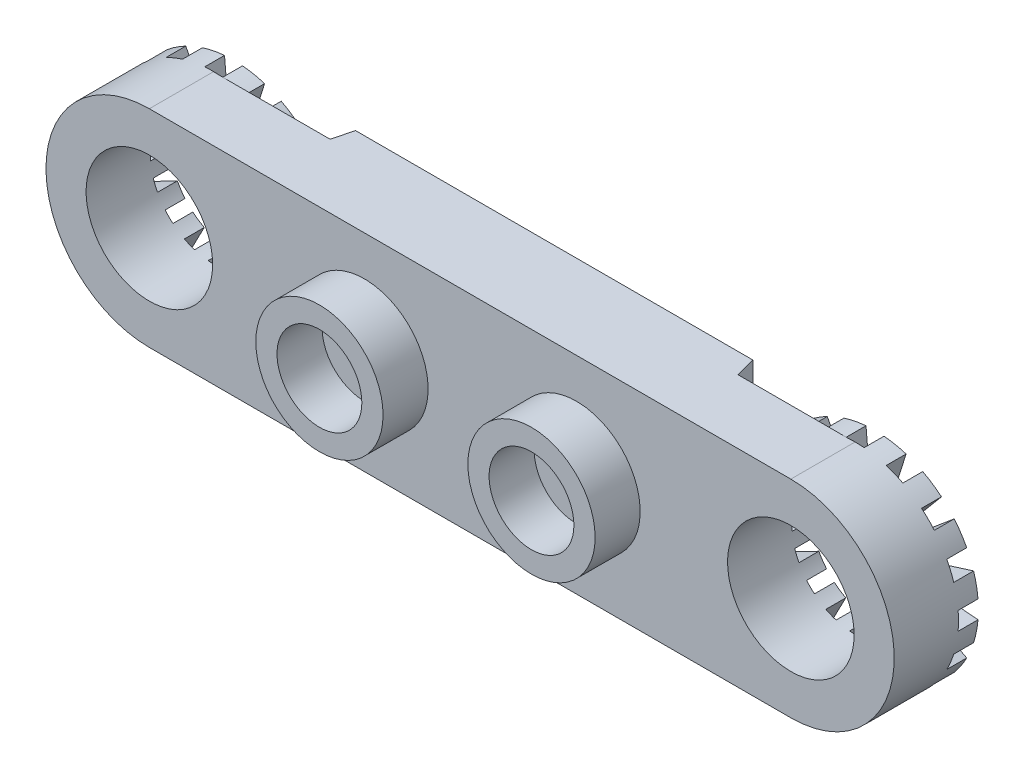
from build123d import *
from OCP.BRepFilletAPI import BRepFilletAPI_MakeChamfer

# Parameters (mm, degrees)
SKETCH1_R             = 2.3876
EXTRUDE1_DEPTH        = 1.2065
SKETCH3_W             = 14.9924
SKETCH3_H             = 7.8
EXTRUDE2_DEPTH        = 0.762
CHAMFER1_SIZE         = 0.2
CHAMFER1_SIZE2        = 0.76
SKETCH7_R             = 3.9
SKETCH7_R_2           = 2.3876
EXTRUDE4_DEPTH        = 0.762
CUT_EXTRUDE3_START    = -0.75
CUT_EXTRUDE3_DEPTH    = 0.75
CIRPATTERN1_COUNT     = 16
MIRROR2_START         = -0.75
MIRROR2_COPY_1_DEPTH  = 0.75
MIRROR2_COPY_2_DEPTH  = 0.75
MIRROR2_COPY_3_DEPTH  = 0.75
MIRROR2_COPY_4_DEPTH  = 0.75
MIRROR2_COPY_5_DEPTH  = 0.75
MIRROR2_COPY_6_DEPTH  = 0.75
MIRROR2_COPY_7_DEPTH  = 0.75
MIRROR2_COPY_8_DEPTH  = 0.75
MIRROR2_COPY_9_DEPTH  = 0.75
MIRROR2_COPY_10_DEPTH = 0.75
MIRROR2_COPY_11_DEPTH = 0.75
MIRROR2_COPY_12_DEPTH = 0.75
MIRROR2_COPY_13_DEPTH = 0.75
MIRROR2_COPY_14_DEPTH = 0.75
MIRROR2_COPY_15_DEPTH = 0.75
SKETCH10_W            = 12.8
SKETCH10_H            = 4.7
CUT_EXTRUDE4_DEPTH    = 1.7
SKETCH11_R            = 1.5
BOSS_EXTRUDE1_DEPTH   = 1.7
SKETCH12_R            = 2.4
BOSS_EXTRUDE2_DEPTH   = 1.7
SKETCH13_R            = 1.6
CUT_EXTRUDE5_DEPTH    = 1.7


with BuildPart() as part:
    # Sketch1 → Extrude1 (new, symmetric)
    with BuildSketch(Plane.XY):
        with BuildLine():
            Line((12.1, 3.9), (-12.1, 3.9))
            ThreePointArc((-12.1, 3.9), (-16, 0), (-12.1, -3.9))
            Line((-12.1, -3.9), (12.1, -3.9))
            ThreePointArc((12.1, -3.9), (16, 0), (12.1, 3.9))
        make_face()
        with Locations((-12.1, 0)):
            Circle(SKETCH1_R, mode=Mode.SUBTRACT)
        with Locations((12.1, 0)):
            Circle(SKETCH1_R, mode=Mode.SUBTRACT)
    extrude(amount=EXTRUDE1_DEPTH, both=True)

    # Sketch3 → Extrude2 (add)
    with BuildSketch(Plane(origin=(0, 0, -1.2065), x_dir=(-1, 0, 0), z_dir=(0, 0, -1))):
        Rectangle(SKETCH3_W, SKETCH3_H)
    extrude(amount=EXTRUDE2_DEPTH)

    # Chamfer1: one chamfer whose edges measure the first distance from different faces: ONE call of the kernel's chamfer builder (chamfer() names one face for all edges)
    chamfer1_edges_1 = [part.edges().sort_by_distance(p)[0] for p in [
        (7.4962, 0, -1.2065),
    ]]
    chamfer1_side_1 = [part.faces().sort_by_distance(p)[0] for p in [
        (7.61159264, 0, -1.2065),
    ]]
    chamfer1_edges_2 = [part.edges().sort_by_distance(p)[0] for p in [
        (-7.4962, 0, -1.2065),
    ]]
    chamfer1_side_2 = [part.faces().sort_by_distance(p)[0] for p in [
        (-15.88460736, 0, -1.2065),
    ]]
    chamfer1 = BRepFilletAPI_MakeChamfer(part.part.solid().wrapped)
    for e in chamfer1_edges_1:
        chamfer1.Add(CHAMFER1_SIZE, CHAMFER1_SIZE2, e.wrapped, chamfer1_side_1[0].wrapped)  # the first distance lies on this face
    for e in chamfer1_edges_2:
        chamfer1.Add(CHAMFER1_SIZE, CHAMFER1_SIZE2, e.wrapped, chamfer1_side_2[0].wrapped)  # the first distance lies on this face
    add(Compound.cast(chamfer1.Shape()), mode=Mode.REPLACE)

    # Sketch7 → Extrude4 (add)
    with BuildSketch(Plane(origin=(0, 0, -1.2065), x_dir=(-1, 0, 0), z_dir=(0, 0, -1))):
        with Locations((-12.1, 0)):
            Circle(SKETCH7_R)
        with Locations((-12.1, 0)):
            Circle(SKETCH7_R_2, mode=Mode.SUBTRACT)
    extrude4 = extrude(amount=EXTRUDE4_DEPTH)

    # Sketch8 → Cut-Extrude3 (cut)
    with BuildSketch(Plane(origin=(0, 0, -1.9685), x_dir=(-1, 0, 0), z_dir=(0, 0, -1)).offset(CUT_EXTRUDE3_START)):
        with BuildLine():
            Line((-12.308093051, 2.378514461), (-12.439907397, 3.885159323))
            ThreePointArc((-12.439907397, 3.885159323), (-12.1, 3.9), (-11.760092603, 3.885159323))
            Line((-11.760092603, 3.885159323), (-11.891906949, 2.378514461))
            ThreePointArc((-11.891906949, 2.378514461), (-12.1, 2.3876), (-12.308093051, 2.378514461))
        make_face()
    cut_extrude3 = extrude(amount=CUT_EXTRUDE3_DEPTH, mode=Mode.SUBTRACT)

    # CirPattern1: Cut-Extrude3 ×16 about axis
    cirpattern1_axis = Axis((12.1, 0, 0), (0, 0, 1))
    for i in range(1, CIRPATTERN1_COUNT):
        add(cut_extrude3.rotate(cirpattern1_axis, i * 360 / CIRPATTERN1_COUNT), mode=Mode.SUBTRACT)

    # Mirror2: Extrude4, Cut-Extrude3 across plane
    add(extrude4.mirror(Plane(origin=(0, 0, 0), x_dir=(0, 0, 1), z_dir=(1, 0, 0))))
    add(cut_extrude3.mirror(Plane(origin=(0, 0, 0), x_dir=(0, 0, 1), z_dir=(1, 0, 0))), mode=Mode.SUBTRACT)

    # Mirror2 copy 1 sketch → Mirror2 copy 1 (cut)
    with BuildSketch(Plane(origin=(-0.921057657, -4.630469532, -1.9685), x_dir=(0.9238795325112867, -0.3826834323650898, 0), z_dir=(0, 0, -1)).offset(MIRROR2_START)):
        with BuildLine():
            Line((-12.308093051, -2.378514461), (-12.439907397, -3.885159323))
            ThreePointArc((-12.439907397, -3.885159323), (-12.1, -3.9), (-11.760092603, -3.885159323))
            Line((-11.760092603, -3.885159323), (-11.891906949, -2.378514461))
            ThreePointArc((-11.891906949, -2.378514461), (-12.1, -2.3876), (-12.308093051, -2.378514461))
        make_face()
    extrude(amount=MIRROR2_COPY_1_DEPTH, mode=Mode.SUBTRACT)

    # Mirror2 copy 2 sketch → Mirror2 copy 2 (cut)
    with BuildSketch(Plane(origin=(-3.544007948, -8.555992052, -1.9685), x_dir=(0.7071067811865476, -0.7071067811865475, 0), z_dir=(0, 0, -1)).offset(MIRROR2_START)):
        with BuildLine():
            Line((-12.308093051, -2.378514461), (-12.439907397, -3.885159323))
            ThreePointArc((-12.439907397, -3.885159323), (-12.1, -3.9), (-11.760092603, -3.885159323))
            Line((-11.760092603, -3.885159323), (-11.891906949, -2.378514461))
            ThreePointArc((-11.891906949, -2.378514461), (-12.1, -2.3876), (-12.308093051, -2.378514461))
        make_face()
    extrude(amount=MIRROR2_COPY_2_DEPTH, mode=Mode.SUBTRACT)

    # Mirror2 copy 3 sketch → Mirror2 copy 3 (cut)
    with BuildSketch(Plane(origin=(-7.469530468, -11.178942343, -1.9685), x_dir=(0.38268343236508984, -0.9238795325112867, 0), z_dir=(0, 0, -1)).offset(MIRROR2_START)):
        with BuildLine():
            Line((-12.308093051, -2.378514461), (-12.439907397, -3.885159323))
            ThreePointArc((-12.439907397, -3.885159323), (-12.1, -3.9), (-11.760092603, -3.885159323))
            Line((-11.760092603, -3.885159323), (-11.891906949, -2.378514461))
            ThreePointArc((-11.891906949, -2.378514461), (-12.1, -2.3876), (-12.308093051, -2.378514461))
        make_face()
    extrude(amount=MIRROR2_COPY_3_DEPTH, mode=Mode.SUBTRACT)

    # Mirror2 copy 4 sketch → Mirror2 copy 4 (cut)
    with BuildSketch(Plane(origin=(-12.1, -12.1, -1.9685), x_dir=(0, -1, 0), z_dir=(0, 0, -1)).offset(MIRROR2_START)):
        with BuildLine():
            Line((-12.308093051, -2.378514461), (-12.439907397, -3.885159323))
            ThreePointArc((-12.439907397, -3.885159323), (-12.1, -3.9), (-11.760092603, -3.885159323))
            Line((-11.760092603, -3.885159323), (-11.891906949, -2.378514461))
            ThreePointArc((-11.891906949, -2.378514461), (-12.1, -2.3876), (-12.308093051, -2.378514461))
        make_face()
    extrude(amount=MIRROR2_COPY_4_DEPTH, mode=Mode.SUBTRACT)

    # Mirror2 copy 5 sketch → Mirror2 copy 5 (cut)
    with BuildSketch(Plane(origin=(-16.730469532, -11.178942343, -1.9685), x_dir=(-0.3826834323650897, -0.9238795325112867, 0), z_dir=(0, 0, -1)).offset(MIRROR2_START)):
        with BuildLine():
            Line((-12.308093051, -2.378514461), (-12.439907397, -3.885159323))
            ThreePointArc((-12.439907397, -3.885159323), (-12.1, -3.9), (-11.760092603, -3.885159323))
            Line((-11.760092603, -3.885159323), (-11.891906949, -2.378514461))
            ThreePointArc((-11.891906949, -2.378514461), (-12.1, -2.3876), (-12.308093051, -2.378514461))
        make_face()
    extrude(amount=MIRROR2_COPY_5_DEPTH, mode=Mode.SUBTRACT)

    # Mirror2 copy 6 sketch → Mirror2 copy 6 (cut)
    with BuildSketch(Plane(origin=(-20.655992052, -8.555992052, -1.9685), x_dir=(-0.7071067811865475, -0.7071067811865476, 0), z_dir=(0, 0, -1)).offset(MIRROR2_START)):
        with BuildLine():
            Line((-12.308093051, -2.378514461), (-12.439907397, -3.885159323))
            ThreePointArc((-12.439907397, -3.885159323), (-12.1, -3.9), (-11.760092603, -3.885159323))
            Line((-11.760092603, -3.885159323), (-11.891906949, -2.378514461))
            ThreePointArc((-11.891906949, -2.378514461), (-12.1, -2.3876), (-12.308093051, -2.378514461))
        make_face()
    extrude(amount=MIRROR2_COPY_6_DEPTH, mode=Mode.SUBTRACT)

    # Mirror2 copy 7 sketch → Mirror2 copy 7 (cut)
    with BuildSketch(Plane(origin=(-23.278942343, -4.630469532, -1.9685), x_dir=(-0.9238795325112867, -0.3826834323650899, 0), z_dir=(0, 0, -1)).offset(MIRROR2_START)):
        with BuildLine():
            Line((-12.308093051, -2.378514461), (-12.439907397, -3.885159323))
            ThreePointArc((-12.439907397, -3.885159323), (-12.1, -3.9), (-11.760092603, -3.885159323))
            Line((-11.760092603, -3.885159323), (-11.891906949, -2.378514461))
            ThreePointArc((-11.891906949, -2.378514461), (-12.1, -2.3876), (-12.308093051, -2.378514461))
        make_face()
    extrude(amount=MIRROR2_COPY_7_DEPTH, mode=Mode.SUBTRACT)

    # Mirror2 copy 8 sketch → Mirror2 copy 8 (cut)
    with BuildSketch(Plane(origin=(-24.2, 0, -1.9685), x_dir=(-1, 0, 0), z_dir=(0, 0, -1)).offset(MIRROR2_START)):
        with BuildLine():
            Line((-12.308093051, -2.378514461), (-12.439907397, -3.885159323))
            ThreePointArc((-12.439907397, -3.885159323), (-12.1, -3.9), (-11.760092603, -3.885159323))
            Line((-11.760092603, -3.885159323), (-11.891906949, -2.378514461))
            ThreePointArc((-11.891906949, -2.378514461), (-12.1, -2.3876), (-12.308093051, -2.378514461))
        make_face()
    extrude(amount=MIRROR2_COPY_8_DEPTH, mode=Mode.SUBTRACT)

    # Mirror2 copy 9 sketch → Mirror2 copy 9 (cut)
    with BuildSketch(Plane(origin=(-23.278942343, 4.630469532, -1.9685), x_dir=(-0.9238795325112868, 0.38268343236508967, 0), z_dir=(0, 0, -1)).offset(MIRROR2_START)):
        with BuildLine():
            Line((-12.308093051, -2.378514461), (-12.439907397, -3.885159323))
            ThreePointArc((-12.439907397, -3.885159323), (-12.1, -3.9), (-11.760092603, -3.885159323))
            Line((-11.760092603, -3.885159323), (-11.891906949, -2.378514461))
            ThreePointArc((-11.891906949, -2.378514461), (-12.1, -2.3876), (-12.308093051, -2.378514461))
        make_face()
    extrude(amount=MIRROR2_COPY_9_DEPTH, mode=Mode.SUBTRACT)

    # Mirror2 copy 10 sketch → Mirror2 copy 10 (cut)
    with BuildSketch(Plane(origin=(-20.655992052, 8.555992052, -1.9685), x_dir=(-0.7071067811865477, 0.7071067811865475, 0), z_dir=(0, 0, -1)).offset(MIRROR2_START)):
        with BuildLine():
            Line((-12.308093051, -2.378514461), (-12.439907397, -3.885159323))
            ThreePointArc((-12.439907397, -3.885159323), (-12.1, -3.9), (-11.760092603, -3.885159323))
            Line((-11.760092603, -3.885159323), (-11.891906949, -2.378514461))
            ThreePointArc((-11.891906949, -2.378514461), (-12.1, -2.3876), (-12.308093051, -2.378514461))
        make_face()
    extrude(amount=MIRROR2_COPY_10_DEPTH, mode=Mode.SUBTRACT)

    # Mirror2 copy 11 sketch → Mirror2 copy 11 (cut)
    with BuildSketch(Plane(origin=(-16.730469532, 11.178942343, -1.9685), x_dir=(-0.3826834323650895, 0.9238795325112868, 0), z_dir=(0, 0, -1)).offset(MIRROR2_START)):
        with BuildLine():
            Line((-12.308093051, -2.378514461), (-12.439907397, -3.885159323))
            ThreePointArc((-12.439907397, -3.885159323), (-12.1, -3.9), (-11.760092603, -3.885159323))
            Line((-11.760092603, -3.885159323), (-11.891906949, -2.378514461))
            ThreePointArc((-11.891906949, -2.378514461), (-12.1, -2.3876), (-12.308093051, -2.378514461))
        make_face()
    extrude(amount=MIRROR2_COPY_11_DEPTH, mode=Mode.SUBTRACT)

    # Mirror2 copy 12 sketch → Mirror2 copy 12 (cut)
    with BuildSketch(Plane(origin=(-12.1, 12.1, -1.9685), x_dir=(0, 1, 0), z_dir=(0, 0, -1)).offset(MIRROR2_START)):
        with BuildLine():
            Line((-12.308093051, -2.378514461), (-12.439907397, -3.885159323))
            ThreePointArc((-12.439907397, -3.885159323), (-12.1, -3.9), (-11.760092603, -3.885159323))
            Line((-11.760092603, -3.885159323), (-11.891906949, -2.378514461))
            ThreePointArc((-11.891906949, -2.378514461), (-12.1, -2.3876), (-12.308093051, -2.378514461))
        make_face()
    extrude(amount=MIRROR2_COPY_12_DEPTH, mode=Mode.SUBTRACT)

    # Mirror2 copy 13 sketch → Mirror2 copy 13 (cut)
    with BuildSketch(Plane(origin=(-7.469530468, 11.178942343, -1.9685), x_dir=(0.38268343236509, 0.9238795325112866, 0), z_dir=(0, 0, -1)).offset(MIRROR2_START)):
        with BuildLine():
            Line((-12.308093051, -2.378514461), (-12.439907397, -3.885159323))
            ThreePointArc((-12.439907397, -3.885159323), (-12.1, -3.9), (-11.760092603, -3.885159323))
            Line((-11.760092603, -3.885159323), (-11.891906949, -2.378514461))
            ThreePointArc((-11.891906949, -2.378514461), (-12.1, -2.3876), (-12.308093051, -2.378514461))
        make_face()
    extrude(amount=MIRROR2_COPY_13_DEPTH, mode=Mode.SUBTRACT)

    # Mirror2 copy 14 sketch → Mirror2 copy 14 (cut)
    with BuildSketch(Plane(origin=(-3.544007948, 8.555992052, -1.9685), x_dir=(0.7071067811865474, 0.7071067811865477, 0), z_dir=(0, 0, -1)).offset(MIRROR2_START)):
        with BuildLine():
            Line((-12.308093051, -2.378514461), (-12.439907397, -3.885159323))
            ThreePointArc((-12.439907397, -3.885159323), (-12.1, -3.9), (-11.760092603, -3.885159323))
            Line((-11.760092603, -3.885159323), (-11.891906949, -2.378514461))
            ThreePointArc((-11.891906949, -2.378514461), (-12.1, -2.3876), (-12.308093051, -2.378514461))
        make_face()
    extrude(amount=MIRROR2_COPY_14_DEPTH, mode=Mode.SUBTRACT)

    # Mirror2 copy 15 sketch → Mirror2 copy 15 (cut)
    with BuildSketch(Plane(origin=(-0.921057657, 4.630469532, -1.9685), x_dir=(0.9238795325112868, 0.38268343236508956, 0), z_dir=(0, 0, -1)).offset(MIRROR2_START)):
        with BuildLine():
            Line((-12.308093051, -2.378514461), (-12.439907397, -3.885159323))
            ThreePointArc((-12.439907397, -3.885159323), (-12.1, -3.9), (-11.760092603, -3.885159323))
            Line((-11.760092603, -3.885159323), (-11.891906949, -2.378514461))
            ThreePointArc((-11.891906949, -2.378514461), (-12.1, -2.3876), (-12.308093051, -2.378514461))
        make_face()
    extrude(amount=MIRROR2_COPY_15_DEPTH, mode=Mode.SUBTRACT)

    # Sketch10 → Cut-Extrude4 (cut)
    with BuildSketch(Plane(origin=(0, 0, -1.9685), x_dir=(-1, 0, 0), z_dir=(0, 0, -1))):
        with Locations((-0.0162, 0)):
            Rectangle(SKETCH10_W, SKETCH10_H)
    extrude(amount=-CUT_EXTRUDE4_DEPTH, mode=Mode.SUBTRACT)

    # Sketch11 → Boss-Extrude1 (add)
    with BuildSketch(Plane(origin=(0, 0, -0.2685), x_dir=(-1, 0, 0), z_dir=(0, 0, -1))):
        with Locations((-0.0162, 0)):
            Circle(SKETCH11_R)
    extrude(amount=BOSS_EXTRUDE1_DEPTH)

    # Sketch12 → Boss-Extrude2 (add)
    with BuildSketch(Plane.XY.offset(1.2065)):
        with Locations(Location((-3.9838, 0, 0), (0, 0, 180))):
            Circle(SKETCH12_R)
        with Locations(Location((4.0162, 0, 0), (0, 0, 180))):
            Circle(SKETCH12_R)
    extrude(amount=BOSS_EXTRUDE2_DEPTH)

    # Sketch13 → Cut-Extrude5 (cut)
    with BuildSketch(Plane.XY.offset(2.9065)):
        with Locations((-3.9838, 0)):
            Circle(SKETCH13_R)
        with Locations((4.0162, 0)):
            Circle(SKETCH13_R)
    extrude(amount=-CUT_EXTRUDE5_DEPTH, mode=Mode.SUBTRACT)


solid = part.part
